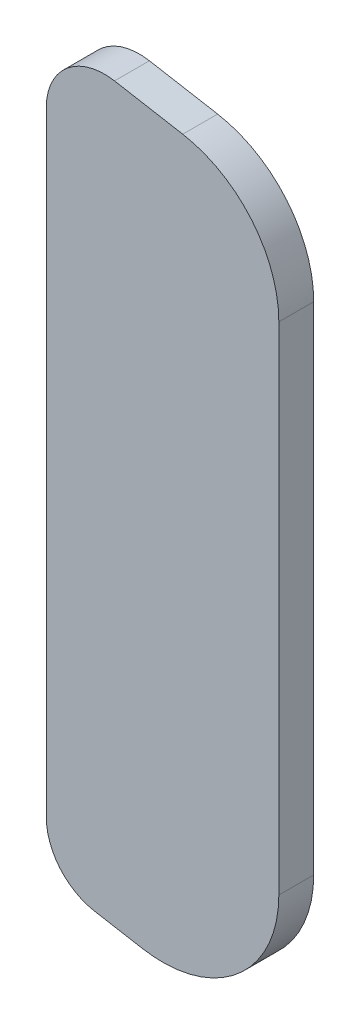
ISO-10303-21;
HEADER;
FILE_DESCRIPTION(('STEP AP214'),'2;1');
FILE_NAME('part.step','',(''),(''),'','','');
FILE_SCHEMA(('AUTOMOTIVE_DESIGN { 1 0 10303 214 1 1 1 1 }'));
ENDSEC;
DATA;
#1=APPLICATION_CONTEXT('core data for automotive mechanical design processes');
#2=APPLICATION_PROTOCOL_DEFINITION('international standard','automotive_design',2000,#1);
#3=PRODUCT_CONTEXT('',#1,'mechanical');
#4=PRODUCT('Part','Part','',(#3));
#5=PRODUCT_RELATED_PRODUCT_CATEGORY('part','',(#4));
#6=PRODUCT_DEFINITION_FORMATION('','',#4);
#7=PRODUCT_DEFINITION_CONTEXT('part definition',#1,'design');
#8=PRODUCT_DEFINITION('design','',#6,#7);
#9=PRODUCT_DEFINITION_SHAPE('','',#8);
#10=(LENGTH_UNIT() NAMED_UNIT(*) SI_UNIT(.MILLI.,.METRE.));
#11=(NAMED_UNIT(*) PLANE_ANGLE_UNIT() SI_UNIT($,.RADIAN.));
#12=(NAMED_UNIT(*) SI_UNIT($,.STERADIAN.) SOLID_ANGLE_UNIT());
#13=UNCERTAINTY_MEASURE_WITH_UNIT(LENGTH_MEASURE(1.E-05),#10,'distance_accuracy_value','');
#14=(GEOMETRIC_REPRESENTATION_CONTEXT(3) GLOBAL_UNCERTAINTY_ASSIGNED_CONTEXT((#13)) GLOBAL_UNIT_ASSIGNED_CONTEXT((#10,
#11,#12)) REPRESENTATION_CONTEXT('',''));
#15=CARTESIAN_POINT('',(0.,0.,0.));
#16=DIRECTION('',(0.,0.,1.));
#17=DIRECTION('',(1.,0.,0.));
#18=AXIS2_PLACEMENT_3D('',#15,#16,#17);
#19=CARTESIAN_POINT('',(-11.6499195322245,12.3461907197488,3.));
#20=DIRECTION('',(0.,0.,-1.));
#21=DIRECTION('',(-1.,0.,0.));
#22=AXIS2_PLACEMENT_3D('',#19,#20,#21);
#23=CYLINDRICAL_SURFACE('',#22,5.);
#24=CARTESIAN_POINT('',(-11.6499195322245,12.3461907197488,0.));
#25=DIRECTION('',(0.,0.,1.));
#26=DIRECTION('',(-1.,0.,0.));
#27=AXIS2_PLACEMENT_3D('',#24,#25,#26);
#28=CIRCLE('',#27,5.);
#29=CARTESIAN_POINT('',(-10.7816786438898,17.2702294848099,0.));
#30=VERTEX_POINT('',#29);
#31=CARTESIAN_POINT('',(-16.6499195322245,12.3461907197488,0.));
#32=VERTEX_POINT('',#31);
#33=EDGE_CURVE('E98',#30,#32,#28,.T.);
#34=ORIENTED_EDGE('',*,*,#33,.T.);
#35=DIRECTION('',(0.,0.,-1.));
#36=VECTOR('',#35,1.);
#37=CARTESIAN_POINT('',(-16.6499195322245,12.3461907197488,3.));
#38=LINE('',#37,#36);
#39=CARTESIAN_POINT('',(-16.6499195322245,12.3461907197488,3.));
#40=VERTEX_POINT('',#39);
#41=EDGE_CURVE('E11',#40,#32,#38,.T.);
#42=ORIENTED_EDGE('',*,*,#41,.F.);
#43=CARTESIAN_POINT('',(-11.6499195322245,12.3461907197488,3.));
#44=DIRECTION('',(0.,0.,1.));
#45=DIRECTION('',(-1.,0.,0.));
#46=AXIS2_PLACEMENT_3D('',#43,#44,#45);
#47=CIRCLE('',#46,5.);
#48=CARTESIAN_POINT('',(-10.7816786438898,17.2702294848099,3.));
#49=VERTEX_POINT('',#48);
#50=EDGE_CURVE('E125',#49,#40,#47,.T.);
#51=ORIENTED_EDGE('',*,*,#50,.F.);
#52=DIRECTION('',(0.,0.,-1.));
#53=VECTOR('',#52,1.);
#54=CARTESIAN_POINT('',(-10.7816786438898,17.2702294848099,3.));
#55=LINE('',#54,#53);
#56=EDGE_CURVE('E111',#49,#30,#55,.T.);
#57=ORIENTED_EDGE('',*,*,#56,.T.);
#58=EDGE_LOOP('',(#34,#42,#51,#57));
#59=FACE_BOUND('',#58,.T.);
#60=ADVANCED_FACE('F30',(#59),#23,.T.);
#61=CARTESIAN_POINT('',(-16.6499195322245,-40.4995431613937,3.));
#62=DIRECTION('',(1.,0.,0.));
#63=DIRECTION('',(0.,1.,0.));
#64=AXIS2_PLACEMENT_3D('',#61,#62,#63);
#65=PLANE('',#64);
#66=DIRECTION('',(0.,-1.,0.));
#67=VECTOR('',#66,1.);
#68=CARTESIAN_POINT('',(-16.6499195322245,-40.4995431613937,0.));
#69=LINE('',#68,#67);
#70=CARTESIAN_POINT('',(-16.6499195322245,-40.4995431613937,0.));
#71=VERTEX_POINT('',#70);
#72=EDGE_CURVE('E94',#32,#71,#69,.T.);
#73=ORIENTED_EDGE('',*,*,#72,.T.);
#74=DIRECTION('',(0.,0.,-1.));
#75=VECTOR('',#74,1.);
#76=CARTESIAN_POINT('',(-16.6499195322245,-40.4995431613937,3.));
#77=LINE('',#76,#75);
#78=CARTESIAN_POINT('',(-16.6499195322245,-40.4995431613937,3.));
#79=VERTEX_POINT('',#78);
#80=EDGE_CURVE('E37',#79,#71,#77,.T.);
#81=ORIENTED_EDGE('',*,*,#80,.F.);
#82=DIRECTION('',(0.,-1.,0.));
#83=VECTOR('',#82,1.);
#84=CARTESIAN_POINT('',(-16.6499195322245,-40.4995431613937,3.));
#85=LINE('',#84,#83);
#86=EDGE_CURVE('E107',#40,#79,#85,.T.);
#87=ORIENTED_EDGE('',*,*,#86,.F.);
#88=ORIENTED_EDGE('',*,*,#41,.T.);
#89=EDGE_LOOP('',(#73,#81,#87,#88));
#90=FACE_BOUND('',#89,.T.);
#91=ADVANCED_FACE('F106',(#90),#65,.F.);
#92=CARTESIAN_POINT('',(-11.6499195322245,-40.4995431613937,3.));
#93=DIRECTION('',(0.,0.,-1.));
#94=DIRECTION('',(-1.,0.,0.));
#95=AXIS2_PLACEMENT_3D('',#92,#93,#94);
#96=CYLINDRICAL_SURFACE('',#95,5.00000000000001);
#97=CARTESIAN_POINT('',(-11.6499195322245,-40.4995431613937,0.));
#98=DIRECTION('',(0.,0.,1.));
#99=DIRECTION('',(-1.,0.,0.));
#100=AXIS2_PLACEMENT_3D('',#97,#98,#99);
#101=CIRCLE('',#100,5.00000000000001);
#102=CARTESIAN_POINT('',(-12.5181604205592,-45.4235819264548,0.));
#103=VERTEX_POINT('',#102);
#104=EDGE_CURVE('E100',#71,#103,#101,.T.);
#105=ORIENTED_EDGE('',*,*,#104,.T.);
#106=DIRECTION('',(0.,0.,-1.));
#107=VECTOR('',#106,1.);
#108=CARTESIAN_POINT('',(-12.5181604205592,-45.4235819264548,3.));
#109=LINE('',#108,#107);
#110=CARTESIAN_POINT('',(-12.5181604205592,-45.4235819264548,3.));
#111=VERTEX_POINT('',#110);
#112=EDGE_CURVE('E151',#111,#103,#109,.T.);
#113=ORIENTED_EDGE('',*,*,#112,.F.);
#114=CARTESIAN_POINT('',(-11.6499195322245,-40.4995431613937,3.));
#115=DIRECTION('',(0.,0.,1.));
#116=DIRECTION('',(-1.,0.,0.));
#117=AXIS2_PLACEMENT_3D('',#114,#115,#116);
#118=CIRCLE('',#117,5.00000000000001);
#119=EDGE_CURVE('E128',#79,#111,#118,.T.);
#120=ORIENTED_EDGE('',*,*,#119,.F.);
#121=ORIENTED_EDGE('',*,*,#80,.T.);
#122=EDGE_LOOP('',(#105,#113,#120,#121));
#123=FACE_BOUND('',#122,.T.);
#124=ADVANCED_FACE('F155',(#123),#96,.T.);
#125=CARTESIAN_POINT('',(-8.38640130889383,-46.1521225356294,3.));
#126=DIRECTION('',(0.173648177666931,0.984807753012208,0.));
#127=DIRECTION('',(-0.984807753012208,0.173648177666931,0.));
#128=AXIS2_PLACEMENT_3D('',#125,#126,#127);
#129=PLANE('',#128);
#130=DIRECTION('',(0.984807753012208,-0.173648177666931,0.));
#131=VECTOR('',#130,1.);
#132=CARTESIAN_POINT('',(-8.38640130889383,-46.1521225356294,0.));
#133=LINE('',#132,#131);
#134=CARTESIAN_POINT('',(-8.38640130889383,-46.1521225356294,0.));
#135=VERTEX_POINT('',#134);
#136=EDGE_CURVE('E115',#103,#135,#133,.T.);
#137=ORIENTED_EDGE('',*,*,#136,.T.);
#138=DIRECTION('',(0.,0.,-1.));
#139=VECTOR('',#138,1.);
#140=CARTESIAN_POINT('',(-8.38640130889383,-46.1521225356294,3.));
#141=LINE('',#140,#139);
#142=CARTESIAN_POINT('',(-8.38640130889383,-46.1521225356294,3.));
#143=VERTEX_POINT('',#142);
#144=EDGE_CURVE('E148',#143,#135,#141,.T.);
#145=ORIENTED_EDGE('',*,*,#144,.F.);
#146=DIRECTION('',(0.984807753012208,-0.173648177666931,0.));
#147=VECTOR('',#146,1.);
#148=CARTESIAN_POINT('',(-8.38640130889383,-46.1521225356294,3.));
#149=LINE('',#148,#147);
#150=EDGE_CURVE('E130',#111,#143,#149,.T.);
#151=ORIENTED_EDGE('',*,*,#150,.F.);
#152=ORIENTED_EDGE('',*,*,#112,.T.);
#153=EDGE_LOOP('',(#137,#145,#151,#152));
#154=FACE_BOUND('',#153,.T.);
#155=ADVANCED_FACE('F163',(#154),#129,.F.);
#156=CARTESIAN_POINT('',(-6.64991953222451,-36.3040450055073,3.));
#157=DIRECTION('',(0.,0.,-1.));
#158=DIRECTION('',(-1.,0.,0.));
#159=AXIS2_PLACEMENT_3D('',#156,#157,#158);
#160=CYLINDRICAL_SURFACE('',#159,10.);
#161=CARTESIAN_POINT('',(-6.64991953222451,-36.3040450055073,0.));
#162=DIRECTION('',(0.,0.,1.));
#163=DIRECTION('',(1.,0.,0.));
#164=AXIS2_PLACEMENT_3D('',#161,#162,#163);
#165=CIRCLE('',#164,10.);
#166=CARTESIAN_POINT('',(3.3500804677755,-36.3040450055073,0.));
#167=VERTEX_POINT('',#166);
#168=EDGE_CURVE('E117',#135,#167,#165,.T.);
#169=ORIENTED_EDGE('',*,*,#168,.T.);
#170=DIRECTION('',(0.,0.,-1.));
#171=VECTOR('',#170,1.);
#172=CARTESIAN_POINT('',(3.3500804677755,-36.3040450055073,3.));
#173=LINE('',#172,#171);
#174=CARTESIAN_POINT('',(3.3500804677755,-36.3040450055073,3.));
#175=VERTEX_POINT('',#174);
#176=EDGE_CURVE('E145',#175,#167,#173,.T.);
#177=ORIENTED_EDGE('',*,*,#176,.F.);
#178=CARTESIAN_POINT('',(-6.64991953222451,-36.3040450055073,3.));
#179=DIRECTION('',(0.,0.,1.));
#180=DIRECTION('',(1.,0.,0.));
#181=AXIS2_PLACEMENT_3D('',#178,#179,#180);
#182=CIRCLE('',#181,10.);
#183=EDGE_CURVE('E132',#143,#175,#182,.T.);
#184=ORIENTED_EDGE('',*,*,#183,.F.);
#185=ORIENTED_EDGE('',*,*,#144,.T.);
#186=EDGE_LOOP('',(#169,#177,#184,#185));
#187=FACE_BOUND('',#186,.T.);
#188=ADVANCED_FACE('F166',(#187),#160,.T.);
#189=CARTESIAN_POINT('',(3.35008046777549,6.38742275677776,3.));
#190=DIRECTION('',(-1.,0.,0.));
#191=DIRECTION('',(0.,-1.,0.));
#192=AXIS2_PLACEMENT_3D('',#189,#190,#191);
#193=PLANE('',#192);
#194=DIRECTION('',(0.,1.,0.));
#195=VECTOR('',#194,1.);
#196=CARTESIAN_POINT('',(3.35008046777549,6.38742275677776,0.));
#197=LINE('',#196,#195);
#198=CARTESIAN_POINT('',(3.35008046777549,6.38742275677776,0.));
#199=VERTEX_POINT('',#198);
#200=EDGE_CURVE('E119',#167,#199,#197,.T.);
#201=ORIENTED_EDGE('',*,*,#200,.T.);
#202=DIRECTION('',(0.,0.,-1.));
#203=VECTOR('',#202,1.);
#204=CARTESIAN_POINT('',(3.35008046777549,6.38742275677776,3.));
#205=LINE('',#204,#203);
#206=CARTESIAN_POINT('',(3.35008046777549,6.38742275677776,3.));
#207=VERTEX_POINT('',#206);
#208=EDGE_CURVE('E142',#207,#199,#205,.T.);
#209=ORIENTED_EDGE('',*,*,#208,.F.);
#210=DIRECTION('',(0.,1.,0.));
#211=VECTOR('',#210,1.);
#212=CARTESIAN_POINT('',(3.35008046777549,6.38742275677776,3.));
#213=LINE('',#212,#211);
#214=EDGE_CURVE('E134',#175,#207,#213,.T.);
#215=ORIENTED_EDGE('',*,*,#214,.F.);
#216=ORIENTED_EDGE('',*,*,#176,.T.);
#217=EDGE_LOOP('',(#201,#209,#215,#216));
#218=FACE_BOUND('',#217,.T.);
#219=ADVANCED_FACE('F171',(#218),#193,.F.);
#220=CARTESIAN_POINT('',(-6.64991953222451,6.38742275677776,3.));
#221=DIRECTION('',(0.,0.,-1.));
#222=DIRECTION('',(-1.,0.,0.));
#223=AXIS2_PLACEMENT_3D('',#220,#221,#222);
#224=CYLINDRICAL_SURFACE('',#223,10.);
#225=CARTESIAN_POINT('',(-6.64991953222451,6.38742275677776,0.));
#226=DIRECTION('',(0.,0.,1.));
#227=DIRECTION('',(-1.,0.,0.));
#228=AXIS2_PLACEMENT_3D('',#225,#226,#227);
#229=CIRCLE('',#228,10.);
#230=CARTESIAN_POINT('',(-4.91343775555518,16.2355002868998,0.));
#231=VERTEX_POINT('',#230);
#232=EDGE_CURVE('E121',#199,#231,#229,.T.);
#233=ORIENTED_EDGE('',*,*,#232,.T.);
#234=DIRECTION('',(0.,0.,-1.));
#235=VECTOR('',#234,1.);
#236=CARTESIAN_POINT('',(-4.91343775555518,16.2355002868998,3.));
#237=LINE('',#236,#235);
#238=CARTESIAN_POINT('',(-4.91343775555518,16.2355002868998,3.));
#239=VERTEX_POINT('',#238);
#240=EDGE_CURVE('E139',#239,#231,#237,.T.);
#241=ORIENTED_EDGE('',*,*,#240,.F.);
#242=CARTESIAN_POINT('',(-6.64991953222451,6.38742275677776,3.));
#243=DIRECTION('',(0.,0.,1.));
#244=DIRECTION('',(-1.,0.,0.));
#245=AXIS2_PLACEMENT_3D('',#242,#243,#244);
#246=CIRCLE('',#245,10.);
#247=EDGE_CURVE('E49',#207,#239,#246,.T.);
#248=ORIENTED_EDGE('',*,*,#247,.F.);
#249=ORIENTED_EDGE('',*,*,#208,.T.);
#250=EDGE_LOOP('',(#233,#241,#248,#249));
#251=FACE_BOUND('',#250,.T.);
#252=ADVANCED_FACE('F174',(#251),#224,.T.);
#253=CARTESIAN_POINT('',(-10.7816786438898,17.2702294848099,3.));
#254=DIRECTION('',(-0.173648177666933,-0.984807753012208,0.));
#255=DIRECTION('',(0.984807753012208,-0.173648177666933,0.));
#256=AXIS2_PLACEMENT_3D('',#253,#254,#255);
#257=PLANE('',#256);
#258=DIRECTION('',(-0.984807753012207,0.173648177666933,0.));
#259=VECTOR('',#258,1.);
#260=CARTESIAN_POINT('',(-10.7816786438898,17.2702294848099,0.));
#261=LINE('',#260,#259);
#262=EDGE_CURVE('E123',#231,#30,#261,.T.);
#263=ORIENTED_EDGE('',*,*,#262,.T.);
#264=ORIENTED_EDGE('',*,*,#56,.F.);
#265=DIRECTION('',(-0.984807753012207,0.173648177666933,0.));
#266=VECTOR('',#265,1.);
#267=CARTESIAN_POINT('',(-10.7816786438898,17.2702294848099,3.));
#268=LINE('',#267,#266);
#269=EDGE_CURVE('E44',#239,#49,#268,.T.);
#270=ORIENTED_EDGE('',*,*,#269,.F.);
#271=ORIENTED_EDGE('',*,*,#240,.T.);
#272=EDGE_LOOP('',(#263,#264,#270,#271));
#273=FACE_BOUND('',#272,.T.);
#274=ADVANCED_FACE('F176',(#273),#257,.F.);
#275=CARTESIAN_POINT('',(-11.6499195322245,12.3461907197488,3.));
#276=DIRECTION('',(0.,0.,-1.));
#277=DIRECTION('',(-1.,0.,0.));
#278=AXIS2_PLACEMENT_3D('',#275,#276,#277);
#279=PLANE('',#278);
#280=ORIENTED_EDGE('',*,*,#50,.T.);
#281=ORIENTED_EDGE('',*,*,#86,.T.);
#282=ORIENTED_EDGE('',*,*,#119,.T.);
#283=ORIENTED_EDGE('',*,*,#150,.T.);
#284=ORIENTED_EDGE('',*,*,#183,.T.);
#285=ORIENTED_EDGE('',*,*,#214,.T.);
#286=ORIENTED_EDGE('',*,*,#247,.T.);
#287=ORIENTED_EDGE('',*,*,#269,.T.);
#288=EDGE_LOOP('',(#280,#281,#282,#283,#284,#285,#286,#287));
#289=FACE_BOUND('',#288,.T.);
#290=ADVANCED_FACE('F158',(#289),#279,.F.);
#291=CARTESIAN_POINT('',(-11.6499195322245,12.3461907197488,0.));
#292=DIRECTION('',(0.,0.,-1.));
#293=DIRECTION('',(-1.,0.,0.));
#294=AXIS2_PLACEMENT_3D('',#291,#292,#293);
#295=PLANE('',#294);
#296=ORIENTED_EDGE('',*,*,#33,.F.);
#297=ORIENTED_EDGE('',*,*,#262,.F.);
#298=ORIENTED_EDGE('',*,*,#232,.F.);
#299=ORIENTED_EDGE('',*,*,#200,.F.);
#300=ORIENTED_EDGE('',*,*,#168,.F.);
#301=ORIENTED_EDGE('',*,*,#136,.F.);
#302=ORIENTED_EDGE('',*,*,#104,.F.);
#303=ORIENTED_EDGE('',*,*,#72,.F.);
#304=EDGE_LOOP('',(#296,#297,#298,#299,#300,#301,#302,#303));
#305=FACE_BOUND('',#304,.T.);
#306=ADVANCED_FACE('F95',(#305),#295,.T.);
#307=CLOSED_SHELL('',(#60,#91,#124,#155,#188,#219,#252,#274,#290,#306));
#308=MANIFOLD_SOLID_BREP('B2',#307);
#309=ADVANCED_BREP_SHAPE_REPRESENTATION('',(#18,#308),#14);
#310=SHAPE_DEFINITION_REPRESENTATION(#9,#309);
ENDSEC;
END-ISO-10303-21;
